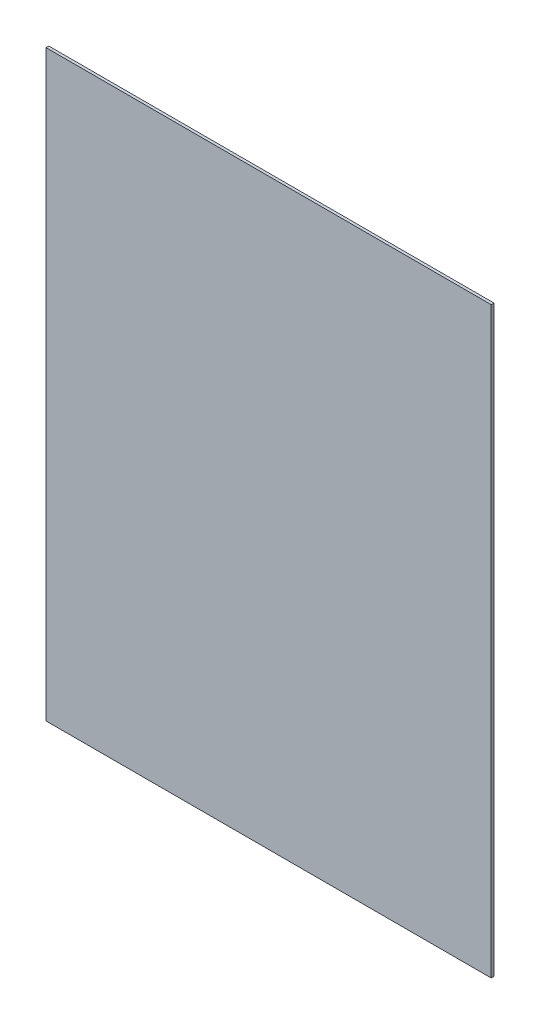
from build123d import *

# Parameters (mm, degrees)
SKETCH1_W           = 481
SKETCH1_H           = 630
BOSS_EXTRUDE1_DEPTH = 3


with BuildPart() as part:
    # Sketch1 → Boss-Extrude1 (new body)
    with BuildSketch(Plane.XY):
        with Locations((240.5, 315)):
            Rectangle(SKETCH1_W, SKETCH1_H)
    extrude(amount=BOSS_EXTRUDE1_DEPTH)


solid = part.part
